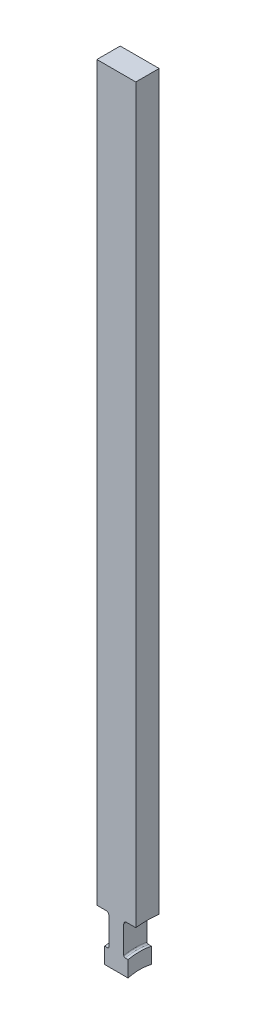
from build123d import *

# Parameters (mm, degrees)
SKETCH1_W               = 6
SKETCH1_H               = 212
BOSS_EXTRUDE1_DEPTH     = 5
CUT_EXTRUDE4_DEPTH      = 213.080173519
CUT_EXTRUDE4_DEPTH_BACK = 213.080173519
SKETCH8_R               = 12
SKETCH2_W               = 3.095
SKETCH2_H               = 8
CUT_EXTRUDE3_DEPTH      = 213.080173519
CUT_EXTRUDE3_DEPTH_BACK = 213.080173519
SKETCH7_W               = 2
SKETCH7_H               = 16
FILLET1_R               = 0.762
FILLET2_R               = 0.381


with BuildPart() as part:
    # Sketch1 → Boss-Extrude1 (new, symmetric)
    with BuildSketch(Plane(origin=(0, 0, 0), x_dir=(0, 0, -1), z_dir=(1, 0, 0))):
        with Locations((0, 106)):
            Rectangle(SKETCH1_W, SKETCH1_H)
    extrude(amount=BOSS_EXTRUDE1_DEPTH, both=True)

    # Sketch8 → Cut-Extrude4 (cut, two sides: drawn at the far end of the back side and taken through both)
    with BuildSketch(Plane(origin=(0, 0, 0), x_dir=(0, 0, -1), z_dir=(1, 0, 0)).offset(-CUT_EXTRUDE4_DEPTH_BACK)):
        Circle(SKETCH8_R)
    extrude(amount=CUT_EXTRUDE4_DEPTH + CUT_EXTRUDE4_DEPTH_BACK, mode=Mode.SUBTRACT)

    # Sketch2 → Cut-Revolve1 (revolve, cut)
    with BuildSketch(Plane.XY):
        with Locations((3.4525, 20)):
            Rectangle(SKETCH2_W, SKETCH2_H)
        with Locations((-3.4525, 20)):
            Rectangle(SKETCH2_W, SKETCH2_H)
    revolve(axis=Axis((-8.84822894, 0, 0), (1, 0, 0)), mode=Mode.SUBTRACT)

    # Sketch7 → Cut-Extrude3 (cut, two sides: drawn at the far end of the back side and taken through both)
    with BuildSketch(Plane.XY.offset(-CUT_EXTRUDE3_DEPTH_BACK)):
        with Locations((-4, 8)):
            Rectangle(SKETCH7_W, SKETCH7_H)
        with Locations((4, 8)):
            Rectangle(SKETCH7_W, SKETCH7_H)
    extrude(amount=CUT_EXTRUDE3_DEPTH + CUT_EXTRUDE3_DEPTH_BACK, mode=Mode.SUBTRACT)

    # Fillet1
    fillet1_edges = [part.edges().sort_by_distance(p)[0] for p in [
        (1.905, 24, 0),
        (-1.905, 24, 0),
    ]]
    fillet(fillet1_edges, radius=FILLET1_R)

    # Fillet2
    fillet2_edges = [part.edges().sort_by_distance(p)[0] for p in [
        (1.905, 16, 0),
        (-1.905, 16, 0),
    ]]
    fillet(fillet2_edges, radius=FILLET2_R)


solid = part.part
